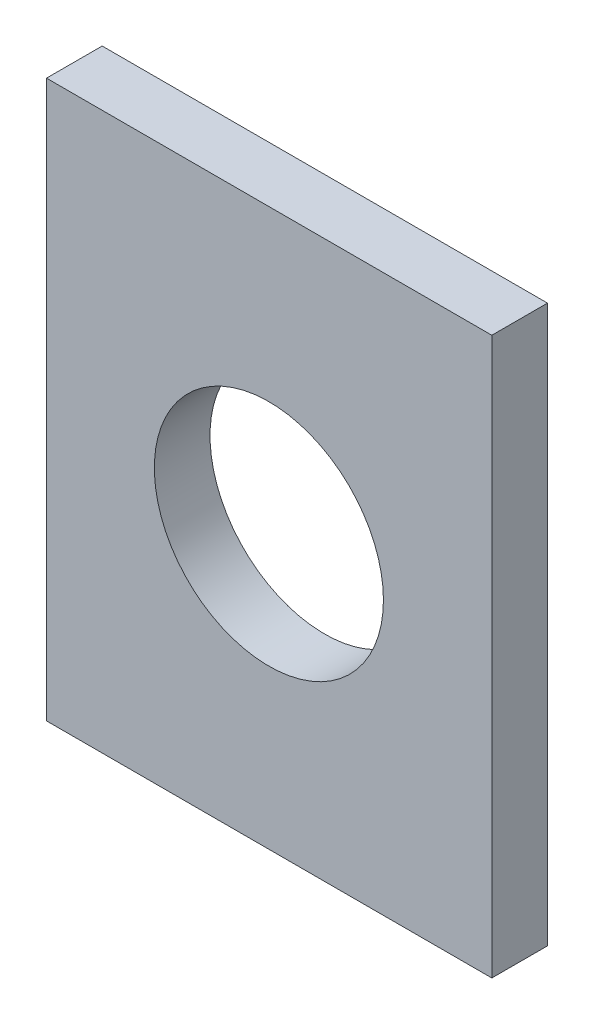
from build123d import *

# Parameters (mm, degrees)
SKIZZE1_W               = 80
SKIZZE1_H               = 100
LINEAR_AUSTRAGEN1_DEPTH = 10
SKIZZE2_R               = 20.578002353
LINEAR_AUSTRAGEN2_DEPTH = 10


with BuildPart() as part:
    # Skizze1 → Linear austragen1 (new body)
    with BuildSketch(Plane.XY):
        with Locations((40, 50)):
            Rectangle(SKIZZE1_W, SKIZZE1_H)
    extrude(amount=LINEAR_AUSTRAGEN1_DEPTH)

    # Skizze2 → Linear austragen2 (cut)
    with BuildSketch(Plane.XY.offset(10)):
        with Locations((39.949219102, 49.067082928)):
            Circle(SKIZZE2_R)
    extrude(amount=-LINEAR_AUSTRAGEN2_DEPTH, mode=Mode.SUBTRACT)


solid = part.part
